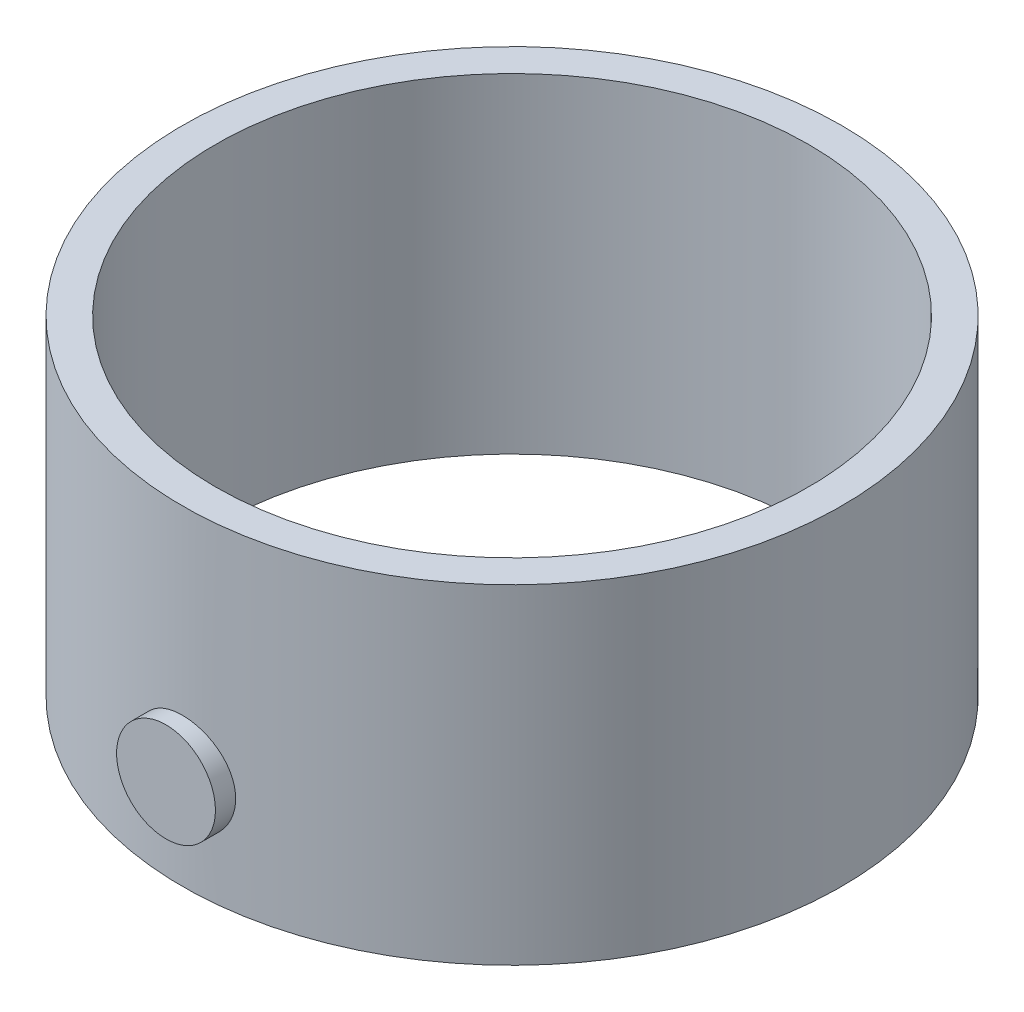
ISO-10303-21;
HEADER;
FILE_DESCRIPTION(('STEP AP214'),'2;1');
FILE_NAME('part.step','',(''),(''),'','','');
FILE_SCHEMA(('AUTOMOTIVE_DESIGN { 1 0 10303 214 1 1 1 1 }'));
ENDSEC;
DATA;
#1=APPLICATION_CONTEXT('core data for automotive mechanical design processes');
#2=APPLICATION_PROTOCOL_DEFINITION('international standard','automotive_design',2000,#1);
#3=PRODUCT_CONTEXT('',#1,'mechanical');
#4=PRODUCT('Part','Part','',(#3));
#5=PRODUCT_RELATED_PRODUCT_CATEGORY('part','',(#4));
#6=PRODUCT_DEFINITION_FORMATION('','',#4);
#7=PRODUCT_DEFINITION_CONTEXT('part definition',#1,'design');
#8=PRODUCT_DEFINITION('design','',#6,#7);
#9=PRODUCT_DEFINITION_SHAPE('','',#8);
#10=(LENGTH_UNIT() NAMED_UNIT(*) SI_UNIT(.MILLI.,.METRE.));
#11=(NAMED_UNIT(*) PLANE_ANGLE_UNIT() SI_UNIT($,.RADIAN.));
#12=(NAMED_UNIT(*) SI_UNIT($,.STERADIAN.) SOLID_ANGLE_UNIT());
#13=UNCERTAINTY_MEASURE_WITH_UNIT(LENGTH_MEASURE(1.E-05),#10,'distance_accuracy_value','');
#14=(GEOMETRIC_REPRESENTATION_CONTEXT(3) GLOBAL_UNCERTAINTY_ASSIGNED_CONTEXT((#13)) GLOBAL_UNIT_ASSIGNED_CONTEXT((#10,
#11,#12)) REPRESENTATION_CONTEXT('',''));
#15=CARTESIAN_POINT('',(0.,0.,0.));
#16=DIRECTION('',(0.,0.,1.));
#17=DIRECTION('',(1.,0.,0.));
#18=AXIS2_PLACEMENT_3D('',#15,#16,#17);
#19=CARTESIAN_POINT('',(0.,254.,0.));
#20=DIRECTION('',(0.,1.,0.));
#21=DIRECTION('',(0.,0.,1.));
#22=AXIS2_PLACEMENT_3D('',#19,#20,#21);
#23=PLANE('',#22);
#24=CARTESIAN_POINT('',(0.,254.,0.));
#25=DIRECTION('',(0.,-1.,0.));
#26=DIRECTION('',(0.,0.,-1.));
#27=AXIS2_PLACEMENT_3D('',#24,#25,#26);
#28=CIRCLE('',#27,254.);
#29=CARTESIAN_POINT('',(0.,254.,-254.));
#30=VERTEX_POINT('',#29);
#31=EDGE_CURVE('E39',#30,#30,#28,.T.);
#32=ORIENTED_EDGE('',*,*,#31,.F.);
#33=EDGE_LOOP('',(#32));
#34=FACE_BOUND('',#33,.T.);
#35=CARTESIAN_POINT('',(0.,254.,0.));
#36=DIRECTION('',(0.,1.,0.));
#37=DIRECTION('',(0.,0.,1.));
#38=AXIS2_PLACEMENT_3D('',#35,#36,#37);
#39=CIRCLE('',#38,228.6);
#40=CARTESIAN_POINT('',(0.,254.,228.6));
#41=VERTEX_POINT('',#40);
#42=EDGE_CURVE('E47',#41,#41,#39,.F.);
#43=ORIENTED_EDGE('',*,*,#42,.T.);
#44=EDGE_LOOP('',(#43));
#45=FACE_BOUND('',#44,.T.);
#46=ADVANCED_FACE('F30',(#34,#45),#23,.T.);
#47=CARTESIAN_POINT('',(0.,0.,0.));
#48=DIRECTION('',(0.,-1.,0.));
#49=DIRECTION('',(0.,0.,-1.));
#50=AXIS2_PLACEMENT_3D('',#47,#48,#49);
#51=CYLINDRICAL_SURFACE('',#50,254.);
#52=CARTESIAN_POINT('',(38.1,76.2,251.126243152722));
#53=CARTESIAN_POINT('',(38.0999934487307,77.2637251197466,251.126245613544));
#54=CARTESIAN_POINT('',(38.0554140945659,78.3276144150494,251.133020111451));
#55=CARTESIAN_POINT('',(37.877403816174,80.4478984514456,251.159929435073));
#56=CARTESIAN_POINT('',(37.7439541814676,81.5042915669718,251.180067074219));
#57=CARTESIAN_POINT('',(37.3890509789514,83.6028535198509,251.233140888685));
#58=CARTESIAN_POINT('',(37.1675190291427,84.645008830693,251.266088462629));
#59=CARTESIAN_POINT('',(36.6381382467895,86.7066389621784,251.343824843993));
#60=CARTESIAN_POINT('',(36.3302938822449,87.7261149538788,251.388613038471));
#61=CARTESIAN_POINT('',(35.6308422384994,89.7345093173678,251.488702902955));
#62=CARTESIAN_POINT('',(35.2392986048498,90.7234502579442,251.54399658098));
#63=CARTESIAN_POINT('',(34.3751674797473,92.6647105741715,251.663541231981));
#64=CARTESIAN_POINT('',(33.9025790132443,93.6170295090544,251.727792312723));
#65=CARTESIAN_POINT('',(32.8798327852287,95.4783308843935,251.863420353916));
#66=CARTESIAN_POINT('',(32.3296869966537,96.3873199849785,251.934796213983));
#67=CARTESIAN_POINT('',(31.1556505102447,98.1559110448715,252.082675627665));
#68=CARTESIAN_POINT('',(30.5317595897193,99.0155128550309,252.159179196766));
#69=CARTESIAN_POINT('',(29.2098414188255,100.685450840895,252.315737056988));
#70=CARTESIAN_POINT('',(28.5113150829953,101.49538996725,252.395812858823));
#71=CARTESIAN_POINT('',(27.0487092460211,103.053662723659,252.556743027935));
#72=CARTESIAN_POINT('',(26.2846294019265,103.801996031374,252.637597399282));
#73=CARTESIAN_POINT('',(24.696152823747,105.231914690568,252.797818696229));
#74=CARTESIAN_POINT('',(23.8717528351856,105.913496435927,252.87718554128));
#75=CARTESIAN_POINT('',(22.1683535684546,107.205105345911,253.03220219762));
#76=CARTESIAN_POINT('',(21.2893542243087,107.815132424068,253.107852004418));
#77=CARTESIAN_POINT('',(19.4784675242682,108.962074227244,253.253663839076));
#78=CARTESIAN_POINT('',(18.5463457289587,109.498622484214,253.323797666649));
#79=CARTESIAN_POINT('',(16.6396363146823,110.491218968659,253.456180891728));
#80=CARTESIAN_POINT('',(15.6650485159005,110.947266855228,253.518430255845));
#81=CARTESIAN_POINT('',(13.6803474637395,111.77547295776,253.633270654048));
#82=CARTESIAN_POINT('',(12.6702356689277,112.147634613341,253.685862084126));
#83=CARTESIAN_POINT('',(10.6216761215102,112.805289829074,253.779887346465));
#84=CARTESIAN_POINT('',(9.58322859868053,113.09078409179,253.821321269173));
#85=CARTESIAN_POINT('',(7.4933718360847,113.571115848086,253.891579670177));
#86=CARTESIAN_POINT('',(6.44211835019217,113.766617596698,253.920496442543));
#87=CARTESIAN_POINT('',(4.32662846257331,114.068613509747,253.965351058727));
#88=CARTESIAN_POINT('',(3.26239211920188,114.175108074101,253.981288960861));
#89=CARTESIAN_POINT('',(1.1286704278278,114.298268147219,253.999732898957));
#90=CARTESIAN_POINT('',(0.0591853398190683,114.314938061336,254.002239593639));
#91=CARTESIAN_POINT('',(-2.07734526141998,114.258331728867,253.993751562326));
#92=CARTESIAN_POINT('',(-3.14439078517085,114.185055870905,253.982756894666));
#93=CARTESIAN_POINT('',(-5.2597833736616,113.95007422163,253.947720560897));
#94=CARTESIAN_POINT('',(-6.30821180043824,113.789084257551,253.923784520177));
#95=CARTESIAN_POINT('',(-8.38765568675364,113.380371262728,253.863603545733));
#96=CARTESIAN_POINT('',(-9.41867125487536,113.132648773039,253.827358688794));
#97=CARTESIAN_POINT('',(-11.4560687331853,112.552310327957,253.74356761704));
#98=CARTESIAN_POINT('',(-12.4624502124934,112.21969288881,253.696021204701));
#99=CARTESIAN_POINT('',(-14.44356400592,111.472006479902,253.590945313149));
#100=CARTESIAN_POINT('',(-15.4182961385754,111.056937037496,253.533415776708));
#101=CARTESIAN_POINT('',(-17.3330028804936,110.145624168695,253.409729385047));
#102=CARTESIAN_POINT('',(-18.2728324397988,109.649080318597,253.343540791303));
#103=CARTESIAN_POINT('',(-20.1073752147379,108.579482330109,253.204541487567));
#104=CARTESIAN_POINT('',(-21.0020883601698,108.006428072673,253.131730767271));
#105=CARTESIAN_POINT('',(-22.7403431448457,106.787799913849,252.98149736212));
#106=CARTESIAN_POINT('',(-23.5838819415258,106.142221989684,252.904074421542));
#107=CARTESIAN_POINT('',(-25.2140042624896,104.783040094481,252.746759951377));
#108=CARTESIAN_POINT('',(-26.0005873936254,104.069435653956,252.666868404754));
#109=CARTESIAN_POINT('',(-27.518889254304,102.57174545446,252.506038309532));
#110=CARTESIAN_POINT('',(-28.249991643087,101.787035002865,252.425097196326));
#111=CARTESIAN_POINT('',(-29.643560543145,100.15866728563,252.265240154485));
#112=CARTESIAN_POINT('',(-30.306026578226,99.3150096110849,252.186324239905));
#113=CARTESIAN_POINT('',(-31.5576613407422,97.5745859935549,252.032759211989));
#114=CARTESIAN_POINT('',(-32.1468293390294,96.6778195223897,251.958110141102));
#115=CARTESIAN_POINT('',(-33.2476502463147,94.8374209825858,251.815213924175));
#116=CARTESIAN_POINT('',(-33.7593033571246,93.893789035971,251.746966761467));
#117=CARTESIAN_POINT('',(-34.70175245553,91.9654972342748,251.618788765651));
#118=CARTESIAN_POINT('',(-35.1324842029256,90.980805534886,251.55886454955));
#119=CARTESIAN_POINT('',(-35.9093978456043,88.9780586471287,251.449138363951));
#120=CARTESIAN_POINT('',(-36.255579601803,87.9600034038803,251.399336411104));
#121=CARTESIAN_POINT('',(-36.8607632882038,85.8978716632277,251.311316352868));
#122=CARTESIAN_POINT('',(-37.1197702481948,84.8537966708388,251.273097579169));
#123=CARTESIAN_POINT('',(-37.5486450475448,82.7471163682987,251.209367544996));
#124=CARTESIAN_POINT('',(-37.7185136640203,81.6845112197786,251.183856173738));
#125=CARTESIAN_POINT('',(-37.9665884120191,79.558872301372,251.146478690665));
#126=CARTESIAN_POINT('',(-38.0456674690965,78.4959426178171,251.134482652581));
#127=CARTESIAN_POINT('',(-38.1145141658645,76.3671313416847,251.124043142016));
#128=CARTESIAN_POINT('',(-38.1042823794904,75.3012497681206,251.125599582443));
#129=CARTESIAN_POINT('',(-37.9945883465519,73.1742280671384,251.142219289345));
#130=CARTESIAN_POINT('',(-37.8951287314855,72.1130878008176,251.15728215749));
#131=CARTESIAN_POINT('',(-37.607743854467,70.0031273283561,251.200475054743));
#132=CARTESIAN_POINT('',(-37.4198186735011,68.9543071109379,251.228605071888));
#133=CARTESIAN_POINT('',(-36.9580931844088,66.8816880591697,251.296942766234));
#134=CARTESIAN_POINT('',(-36.6847287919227,65.8577900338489,251.337089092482));
#135=CARTESIAN_POINT('',(-36.0538628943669,63.8367639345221,251.428360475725));
#136=CARTESIAN_POINT('',(-35.6963617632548,62.8396357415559,251.479485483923));
#137=CARTESIAN_POINT('',(-34.8998154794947,60.8790156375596,251.59126476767));
#138=CARTESIAN_POINT('',(-34.4607672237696,59.9155250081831,251.651919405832));
#139=CARTESIAN_POINT('',(-33.5042813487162,58.0288198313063,251.781047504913));
#140=CARTESIAN_POINT('',(-32.9868431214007,57.1056055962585,251.849521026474));
#141=CARTESIAN_POINT('',(-31.8730404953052,55.2989501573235,251.992910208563));
#142=CARTESIAN_POINT('',(-31.2761111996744,54.4158607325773,252.067870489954));
#143=CARTESIAN_POINT('',(-30.0105733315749,52.7029919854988,252.221671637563));
#144=CARTESIAN_POINT('',(-29.3419644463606,51.8732128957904,252.300512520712));
#145=CARTESIAN_POINT('',(-27.9376711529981,50.2725997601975,252.459869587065));
#146=CARTESIAN_POINT('',(-27.2019834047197,49.5017686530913,252.540385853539));
#147=CARTESIAN_POINT('',(-25.6686170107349,48.0243795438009,252.700843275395));
#148=CARTESIAN_POINT('',(-24.870938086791,47.3178218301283,252.780784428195));
#149=CARTESIAN_POINT('',(-23.2121486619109,45.9682470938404,252.938521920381));
#150=CARTESIAN_POINT('',(-22.3505644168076,45.3258094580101,253.016294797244));
#151=CARTESIAN_POINT('',(-20.5759064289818,44.115806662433,253.166792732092));
#152=CARTESIAN_POINT('',(-19.6628323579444,43.548241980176,253.239517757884));
#153=CARTESIAN_POINT('',(-17.7915982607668,42.4920893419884,253.377858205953));
#154=CARTESIAN_POINT('',(-16.8334390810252,42.003499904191,253.443473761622));
#155=CARTESIAN_POINT('',(-14.8787750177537,41.1088714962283,253.565732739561));
#156=CARTESIAN_POINT('',(-13.8822703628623,40.7028320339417,253.622376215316));
#157=CARTESIAN_POINT('',(-11.8617459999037,39.9776752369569,253.72488714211));
#158=CARTESIAN_POINT('',(-10.837841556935,39.6582422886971,253.770793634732));
#159=CARTESIAN_POINT('',(-8.76631345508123,39.1067313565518,253.850794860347));
#160=CARTESIAN_POINT('',(-7.71868983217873,38.8746532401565,253.884889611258));
#161=CARTESIAN_POINT('',(-5.60733091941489,38.4996366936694,253.940294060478));
#162=CARTESIAN_POINT('',(-4.54359652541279,38.3566933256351,253.96160446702));
#163=CARTESIAN_POINT('',(-2.40768148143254,38.1610311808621,253.990833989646));
#164=CARTESIAN_POINT('',(-1.33550089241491,38.1083117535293,253.998753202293));
#165=CARTESIAN_POINT('',(0.798957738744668,38.0935765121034,254.000963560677));
#166=CARTESIAN_POINT('',(1.86122963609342,38.1306751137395,253.995387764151));
#167=CARTESIAN_POINT('',(3.97880653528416,38.2934472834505,253.971042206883));
#168=CARTESIAN_POINT('',(5.03411158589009,38.4191202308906,253.95227253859));
#169=CARTESIAN_POINT('',(7.13023672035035,38.7580864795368,253.902065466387));
#170=CARTESIAN_POINT('',(8.17105690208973,38.9713791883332,253.870628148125));
#171=CARTESIAN_POINT('',(10.2308605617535,39.4839831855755,253.795964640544));
#172=CARTESIAN_POINT('',(11.2498439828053,39.7832946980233,253.752738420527));
#173=CARTESIAN_POINT('',(13.2580802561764,40.4654638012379,253.655737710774));
#174=CARTESIAN_POINT('',(14.2473546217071,40.848259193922,253.601971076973));
#175=CARTESIAN_POINT('',(16.1901058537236,41.6947368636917,253.48535966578));
#176=CARTESIAN_POINT('',(17.1435827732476,42.1584190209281,253.422514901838));
#177=CARTESIAN_POINT('',(19.0082192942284,43.1633638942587,253.289481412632));
#178=CARTESIAN_POINT('',(19.9193780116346,43.7046282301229,253.219292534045));
#179=CARTESIAN_POINT('',(21.6931620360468,44.8609256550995,253.073504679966));
#180=CARTESIAN_POINT('',(22.555786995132,45.4759592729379,252.9979056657));
#181=CARTESIAN_POINT('',(24.2344875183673,46.7816238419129,252.842652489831));
#182=CARTESIAN_POINT('',(25.0500518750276,47.4729084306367,252.762966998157));
#183=CARTESIAN_POINT('',(26.620171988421,48.9214850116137,252.602433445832));
#184=CARTESIAN_POINT('',(27.3747271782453,49.6787776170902,252.521585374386));
#185=CARTESIAN_POINT('',(28.8177835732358,51.2543229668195,252.360976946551));
#186=CARTESIAN_POINT('',(29.5062690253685,52.0725901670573,252.281216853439));
#187=CARTESIAN_POINT('',(30.812176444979,53.7642791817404,252.125053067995));
#188=CARTESIAN_POINT('',(31.429599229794,54.6377003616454,252.048649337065));
#189=CARTESIAN_POINT('',(32.5922915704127,56.4387284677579,251.900948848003));
#190=CARTESIAN_POINT('',(33.1371366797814,57.3666120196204,251.829683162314));
#191=CARTESIAN_POINT('',(34.1466468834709,59.2656305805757,251.694787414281));
#192=CARTESIAN_POINT('',(34.6113072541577,60.2367681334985,251.631157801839));
#193=CARTESIAN_POINT('',(35.4565720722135,62.2144040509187,251.513445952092));
#194=CARTESIAN_POINT('',(35.8372559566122,63.2208679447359,251.459354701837));
#195=CARTESIAN_POINT('',(36.5122153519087,65.2627359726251,251.36223791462));
#196=CARTESIAN_POINT('',(36.8065102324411,66.2981335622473,251.319209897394));
#197=CARTESIAN_POINT('',(37.2295564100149,68.0682849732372,251.256821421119));
#198=CARTESIAN_POINT('',(37.3813812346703,68.7975031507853,251.234252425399));
#199=CARTESIAN_POINT('',(37.6420900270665,70.2638777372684,251.195323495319));
#200=CARTESIAN_POINT('',(37.7509685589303,71.0010351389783,251.178964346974));
#201=CARTESIAN_POINT('',(37.9253306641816,72.480571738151,251.15269674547));
#202=CARTESIAN_POINT('',(37.9908146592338,73.2229508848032,251.14278822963));
#203=CARTESIAN_POINT('',(38.0781487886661,74.7101934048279,251.129560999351));
#204=CARTESIAN_POINT('',(38.1000045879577,75.4550564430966,251.126241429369));
#205=CARTESIAN_POINT('',(38.1,76.2,251.126243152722));
#206=B_SPLINE_CURVE_WITH_KNOTS('',3,(#52,#53,#54,#55,#56,#57,#58,#59,#60,#61,#62,#63,#64,#65,
#66,#67,#68,#69,#70,#71,#72,#73,#74,#75,#76,#77,#78,#79,#80,#81,#82,#83,#84,#85,#86,#87,#88,#89,
#90,#91,#92,#93,#94,#95,#96,#97,#98,#99,#100,#101,#102,#103,#104,#105,#106,#107,#108,#109,#110,
#111,#112,#113,#114,#115,#116,#117,#118,#119,#120,#121,#122,#123,#124,#125,#126,#127,#128,#129,
#130,#131,#132,#133,#134,#135,#136,#137,#138,#139,#140,#141,#142,#143,#144,#145,#146,#147,#148,
#149,#150,#151,#152,#153,#154,#155,#156,#157,#158,#159,#160,#161,#162,#163,#164,#165,#166,#167,
#168,#169,#170,#171,#172,#173,#174,#175,#176,#177,#178,#179,#180,#181,#182,#183,#184,#185,#186,
#187,#188,#189,#190,#191,#192,#193,#194,#195,#196,#197,#198,#199,#200,#201,#202,#203,#204,#205),
.UNSPECIFIED.,.T.,.F.,(4,2,2,2,2,2,2,2,2,2,2,2,2,2,2,2,2,2,2,2,2,2,2,2,2,2,2,2,2,2,2,2,2,2,2,2,
2,2,2,2,2,2,2,2,2,2,2,2,2,2,2,2,2,2,2,2,2,2,2,2,2,2,2,2,2,2,2,2,2,2,2,2,2,2,2,2,4),(0.,
3.19050666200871,6.38168525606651,9.57570996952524,12.7695693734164,15.9610087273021,
19.1524864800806,22.3434720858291,25.5344673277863,28.7483225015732,31.9621944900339,
35.176240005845,38.3902894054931,41.6198262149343,44.8493767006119,48.0787947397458,
51.3081865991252,54.5133435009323,57.7184860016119,60.9234713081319,64.1284427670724,
67.3076421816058,70.4868217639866,73.6660569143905,76.8453102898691,80.0365615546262,
83.2278177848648,86.4192511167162,89.6107064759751,92.833579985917,96.0564758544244,
99.2794037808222,102.502323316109,105.727790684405,108.953263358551,112.178549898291,
115.403808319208,118.597789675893,121.791750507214,124.985617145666,128.179480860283,
131.357308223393,134.535121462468,137.713055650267,140.891014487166,144.092899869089,
147.294799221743,150.496858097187,153.69893134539,156.927723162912,160.156535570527,
163.385287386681,166.614019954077,169.830823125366,173.04762141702,176.26424148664,
179.480838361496,182.665849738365,185.850838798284,189.035806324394,192.220782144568,
195.403393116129,198.585999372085,201.76867208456,204.951367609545,208.1638496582,
211.376361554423,214.589637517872,217.802876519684,221.034151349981,224.265616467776,
227.494011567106,230.721682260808,232.956073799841,235.190748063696,237.425400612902,
239.659762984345),.UNSPECIFIED.);
#207=CARTESIAN_POINT('',(38.1,76.2,251.126243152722));
#208=VERTEX_POINT('',#207);
#209=EDGE_CURVE('E10',#208,#208,#206,.T.);
#210=ORIENTED_EDGE('',*,*,#209,.F.);
#211=EDGE_LOOP('',(#210));
#212=FACE_BOUND('',#211,.T.);
#213=ORIENTED_EDGE('',*,*,#31,.T.);
#214=EDGE_LOOP('',(#213));
#215=FACE_BOUND('',#214,.T.);
#216=CARTESIAN_POINT('',(0.,0.,0.));
#217=DIRECTION('',(0.,-1.,0.));
#218=DIRECTION('',(0.,0.,-1.));
#219=AXIS2_PLACEMENT_3D('',#216,#217,#218);
#220=CIRCLE('',#219,254.);
#221=CARTESIAN_POINT('',(0.,0.,-254.));
#222=VERTEX_POINT('',#221);
#223=EDGE_CURVE('E43',#222,#222,#220,.T.);
#224=ORIENTED_EDGE('',*,*,#223,.F.);
#225=EDGE_LOOP('',(#224));
#226=FACE_BOUND('',#225,.T.);
#227=ADVANCED_FACE('F74',(#212,#215,#226),#51,.T.);
#228=CARTESIAN_POINT('',(0.,0.,0.));
#229=DIRECTION('',(0.,-1.,0.));
#230=DIRECTION('',(0.,0.,-1.));
#231=AXIS2_PLACEMENT_3D('',#228,#229,#230);
#232=PLANE('',#231);
#233=CARTESIAN_POINT('',(0.,0.,0.));
#234=DIRECTION('',(0.,-1.,0.));
#235=DIRECTION('',(0.,0.,-1.));
#236=AXIS2_PLACEMENT_3D('',#233,#234,#235);
#237=CIRCLE('',#236,228.6);
#238=CARTESIAN_POINT('',(0.,0.,-228.6));
#239=VERTEX_POINT('',#238);
#240=EDGE_CURVE('E50',#239,#239,#237,.T.);
#241=ORIENTED_EDGE('',*,*,#240,.F.);
#242=EDGE_LOOP('',(#241));
#243=FACE_BOUND('',#242,.T.);
#244=ORIENTED_EDGE('',*,*,#223,.T.);
#245=EDGE_LOOP('',(#244));
#246=FACE_BOUND('',#245,.T.);
#247=ADVANCED_FACE('F71',(#243,#246),#232,.T.);
#248=CARTESIAN_POINT('',(0.,0.,0.));
#249=DIRECTION('',(0.,-1.,0.));
#250=DIRECTION('',(0.,0.,-1.));
#251=AXIS2_PLACEMENT_3D('',#248,#249,#250);
#252=CYLINDRICAL_SURFACE('',#251,228.6);
#253=ORIENTED_EDGE('',*,*,#42,.F.);
#254=EDGE_LOOP('',(#253));
#255=FACE_BOUND('',#254,.T.);
#256=ORIENTED_EDGE('',*,*,#240,.T.);
#257=EDGE_LOOP('',(#256));
#258=FACE_BOUND('',#257,.T.);
#259=ADVANCED_FACE('F63',(#255,#258),#252,.F.);
#260=CARTESIAN_POINT('',(0.,76.2,266.7));
#261=DIRECTION('',(0.,0.,1.));
#262=DIRECTION('',(1.,0.,0.));
#263=AXIS2_PLACEMENT_3D('',#260,#261,#262);
#264=PLANE('',#263);
#265=CARTESIAN_POINT('',(0.,76.2,266.7));
#266=DIRECTION('',(0.,0.,1.));
#267=DIRECTION('',(1.,0.,0.));
#268=AXIS2_PLACEMENT_3D('',#265,#266,#267);
#269=CIRCLE('',#268,38.1);
#270=CARTESIAN_POINT('',(38.1,76.2,266.7));
#271=VERTEX_POINT('',#270);
#272=EDGE_CURVE('E53',#271,#271,#269,.T.);
#273=ORIENTED_EDGE('',*,*,#272,.T.);
#274=EDGE_LOOP('',(#273));
#275=FACE_BOUND('',#274,.T.);
#276=ADVANCED_FACE('F59',(#275),#264,.T.);
#277=CARTESIAN_POINT('',(0.,76.2,-500000.));
#278=DIRECTION('',(0.,0.,1.));
#279=DIRECTION('',(1.,0.,0.));
#280=AXIS2_PLACEMENT_3D('',#277,#278,#279);
#281=CYLINDRICAL_SURFACE('',#280,38.1);
#282=ORIENTED_EDGE('',*,*,#209,.T.);
#283=EDGE_LOOP('',(#282));
#284=FACE_BOUND('',#283,.T.);
#285=ORIENTED_EDGE('',*,*,#272,.F.);
#286=EDGE_LOOP('',(#285));
#287=FACE_BOUND('',#286,.T.);
#288=ADVANCED_FACE('F61',(#284,#287),#281,.T.);
#289=CLOSED_SHELL('',(#46,#227,#247,#259,#276,#288));
#290=MANIFOLD_SOLID_BREP('B2',#289);
#291=ADVANCED_BREP_SHAPE_REPRESENTATION('',(#18,#290),#14);
#292=SHAPE_DEFINITION_REPRESENTATION(#9,#291);
ENDSEC;
END-ISO-10303-21;
